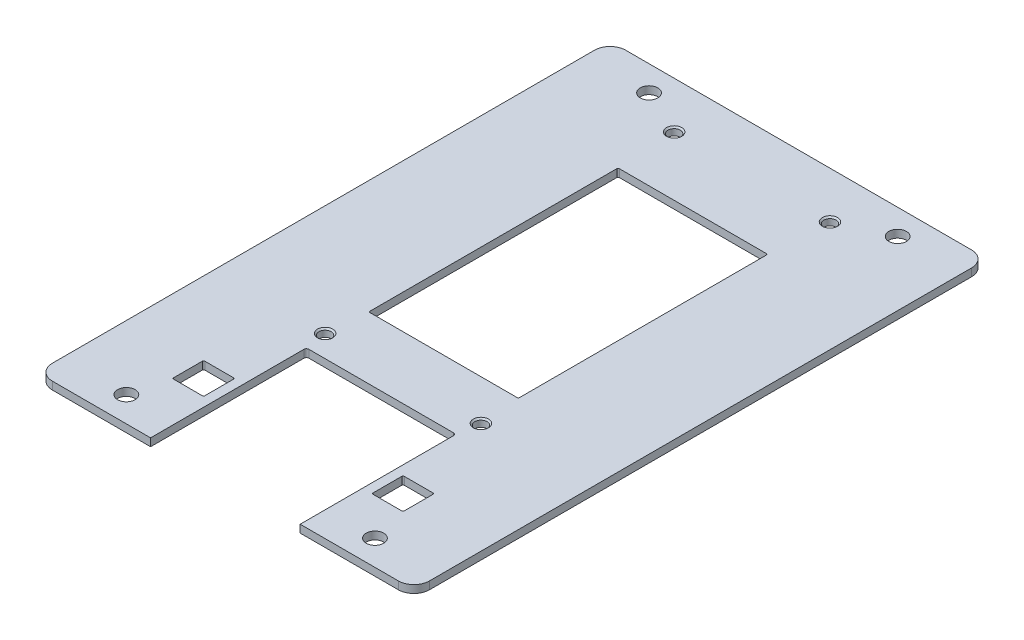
from build123d import *

# Parameters (mm, degrees)
SKETCH1_W          = 76.832299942
SKETCH1_H          = 1.5748
BASE_EXTRUDE_DEPTH = 58.4
SKETCH2_R          = 1.7859375
SKETCH2_R_2        = 1.25
CUT_EXTRUDE1_DEPTH = 1.5748
CHAMFER1_SIZE      = 0.3
FILLET1_R          = 3.175
SKETCH3_W          = 30.48
SKETCH3_H          = 50.8
CUT_EXTRUDE2_DEPTH = 70.920244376
FILLET2_R          = 0.254


with BuildPart() as part:
    # Sketch1 → Base-Extrude (new, symmetric)
    with BuildSketch(Plane.XY):
        Rectangle(SKETCH1_W, SKETCH1_H)
    extrude(amount=BASE_EXTRUDE_DEPTH, both=True)

    # Sketch2 → Cut-Extrude1 (cut)
    with BuildSketch(Plane(origin=(0, 0.7874, 0), x_dir=(-1, 0, 0), z_dir=(0, 1, 0))):
        with Locations(Location((25.325, -53.25, 0), (0, 0, 90))):
            Circle(SKETCH2_R)
        with Locations(Location((-25.325, -53.25, 0), (0, 0, 90))):
            Circle(SKETCH2_R)
        with Locations(Location((25.325, 53.25, 0), (0, 0, 90))):
            Circle(SKETCH2_R)
        with Locations(Location((-25.325, 53.25, 0), (0, 0, 90))):
            Circle(SKETCH2_R)
        with Locations((-15.875, 22.205)):
            Circle(SKETCH2_R_2)
        with Locations((-15.875, -48.915)):
            Circle(SKETCH2_R_2)
        with Locations((15.875, 22.205)):
            Circle(SKETCH2_R_2)
        with Locations((15.875, -48.915)):
            Circle(SKETCH2_R_2)
        with BuildLine():
            Line((23.241, 45.7), (17.399, 45.7))
            ThreePointArc((17.399, 45.7), (17.219394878, 45.625605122), (17.145, 45.446))
            Line((17.145, 45.446), (17.145, 39.604))
            ThreePointArc((17.145, 39.604), (17.219394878, 39.424394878), (17.399, 39.35))
            Line((17.399, 39.35), (23.241, 39.35))
            ThreePointArc((23.241, 39.35), (23.420605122, 39.424394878), (23.495, 39.604))
            Line((23.495, 39.604), (23.495, 45.446))
            ThreePointArc((23.495, 45.446), (23.420605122, 45.625605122), (23.241, 45.7))
        make_face()
        with BuildLine():
            Line((-17.399, 45.7), (-23.241, 45.7))
            ThreePointArc((-23.241, 45.7), (-23.420605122, 45.625605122), (-23.495, 45.446))
            Line((-23.495, 45.446), (-23.495, 39.604))
            ThreePointArc((-23.495, 39.604), (-23.420605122, 39.424394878), (-23.241, 39.35))
            Line((-23.241, 39.35), (-17.399, 39.35))
            ThreePointArc((-17.399, 39.35), (-17.219394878, 39.424394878), (-17.145, 39.604))
            Line((-17.145, 39.604), (-17.145, 45.446))
            ThreePointArc((-17.145, 45.446), (-17.219394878, 45.625605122), (-17.399, 45.7))
        make_face()
    extrude(amount=-CUT_EXTRUDE1_DEPTH, mode=Mode.SUBTRACT)

    # Chamfer1
    chamfer1_edges = [part.edges().sort_by_distance(p)[0] for p in [
        (-14.625, 0.7874, -48.915),
        (17.125, 0.7874, -48.915),
        (-14.625, 0.7874, 22.205),
        (17.125, 0.7874, 22.205),
    ]]
    chamfer(chamfer1_edges, length=CHAMFER1_SIZE)

    # Fillet1
    fillet1_edges = [part.edges().sort_by_distance(p)[0] for p in [
        (-38.416149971, 0, -58.4),
        (-38.416149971, 0, 58.4),
        (38.416149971, 0, -58.4),
        (38.416149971, 0, 58.4),
    ]]
    fillet(fillet1_edges, radius=FILLET1_R)

    # Sketch3 → Cut-Extrude2 (cut, through all)
    with BuildSketch(Plane(origin=(0, 0.7874, 0), x_dir=(-1, 0, 0), z_dir=(0, 1, 0))):
        with BuildLine():
            Line((-15.24, 61.030999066), (15.24, 61.030999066))
            Line((15.24, 61.030999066), (15.24, 27.158))
            ThreePointArc((15.24, 27.158), (15.091210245, 26.798789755), (14.732, 26.65))
            Line((14.732, 26.65), (-14.732, 26.65))
            ThreePointArc((-14.732, 26.65), (-15.091210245, 26.798789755), (-15.24, 27.158))
            Line((-15.24, 27.158), (-15.24, 61.030999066))
        make_face()
        with Locations((0, -11.45)):
            Rectangle(SKETCH3_W, SKETCH3_H)
    extrude(amount=-CUT_EXTRUDE2_DEPTH, mode=Mode.SUBTRACT)

    # Fillet2
    fillet2_edges = [part.edges().sort_by_distance(p)[0] for p in [
        (-15.24, 0, 13.95),
        (-15.24, 0, -36.85),
        (15.24, 0, -36.85),
        (15.24, 0, 13.95),
    ]]
    fillet(fillet2_edges, radius=FILLET2_R)


solid = part.part
